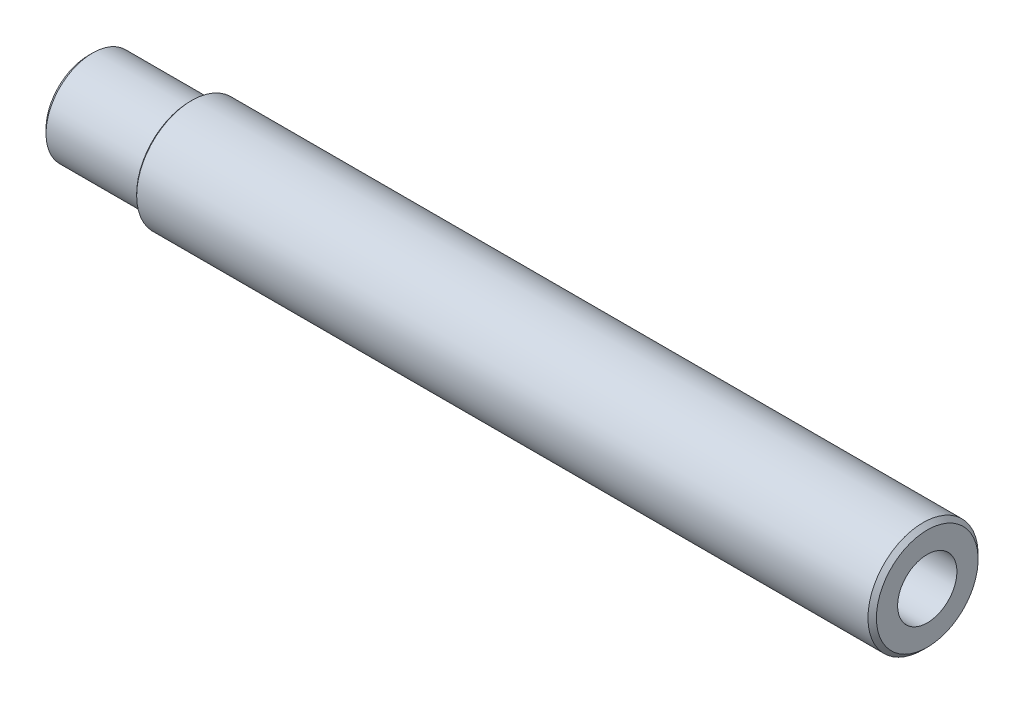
from build123d import *

# Parameters (mm, degrees)
SKETCH2_W = 99
SKETCH2_H = 3.5


with BuildPart() as part:
    # Sketch1 → Revolve1 (revolve)
    with BuildSketch(Plane.XY, mode=Mode.PRIVATE) as revolve1_sk:
        with BuildLine():
            Line((-12, 0), (-12, 5))
            Line((-12, 5), (-11.5, 5.5))
            Line((-11.5, 5.5), (-0.3, 5.5))
            ThreePointArc((-0.3, 5.5), (-0.087867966, 5.587867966), (0, 5.8))
            Line((0, 5.8), (0, 6.3))
            Line((0, 6.3), (0.2, 6.5))
            Line((0.2, 6.5), (86.5, 6.5))
            Line((86.5, 6.5), (87, 6))
            Line((87, 6), (87, 0))
            Line((87, 0), (-12, 0))
        make_face()
    revolve(revolve1_sk.sketch.rotate(Axis((87, 0, 0), (-1, 0, 0)), 270), axis=Axis((87, 0, 0), (-1, 0, 0)))

    # Sketch2 → Cut-Revolve1 (revolve, cut)
    with BuildSketch(Plane.XY, mode=Mode.PRIVATE) as cut_revolve1_sk:
        with Locations((37.5, 1.75)):
            Rectangle(SKETCH2_W, SKETCH2_H)
    revolve(cut_revolve1_sk.sketch.rotate(Axis((87, 0, 0), (-1, 0, 0)), 270), axis=Axis((87, 0, 0), (-1, 0, 0)), mode=Mode.SUBTRACT)


solid = part.part
